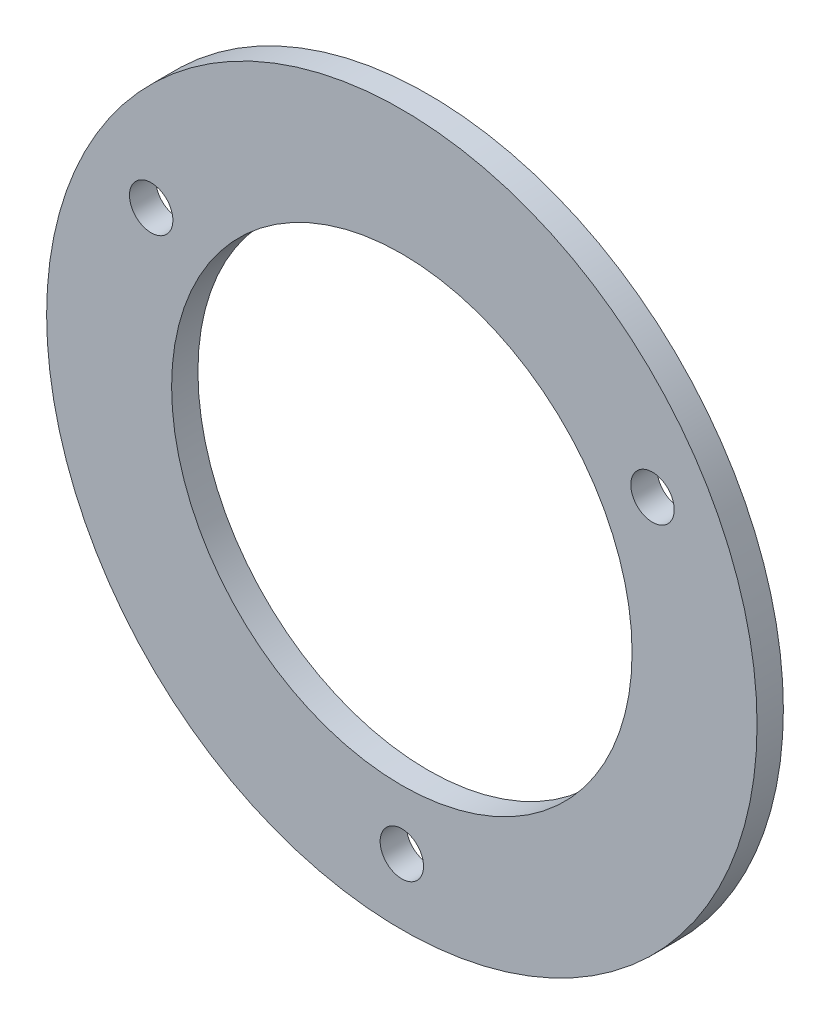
from build123d import *

# Parameters (mm, degrees)
SKETCH_1_R         = 27
SKETCH_1_R_2       = 17.5
EXTRUDE_1_DEPTH    = 2
HOLE_WIZARD_M4_1_D = 3.3


with BuildPart() as part:
    # Sketch 1 → Extrude 1 (new body)
    with BuildSketch(Plane.XY):
        with Locations((25, 92)):
            Circle(SKETCH_1_R)
        with Locations((25, 92)):
            Circle(SKETCH_1_R_2, mode=Mode.SUBTRACT)
    extrude(amount=EXTRUDE_1_DEPTH)

    # Hole Wizard M4 _1 (through all)
    with Locations(Plane.XY.offset(2)):
        with Locations((5.947441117, 103), (25, 70), (44.052558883, 103)):
            Hole(HOLE_WIZARD_M4_1_D / 2)


solid = part.part
